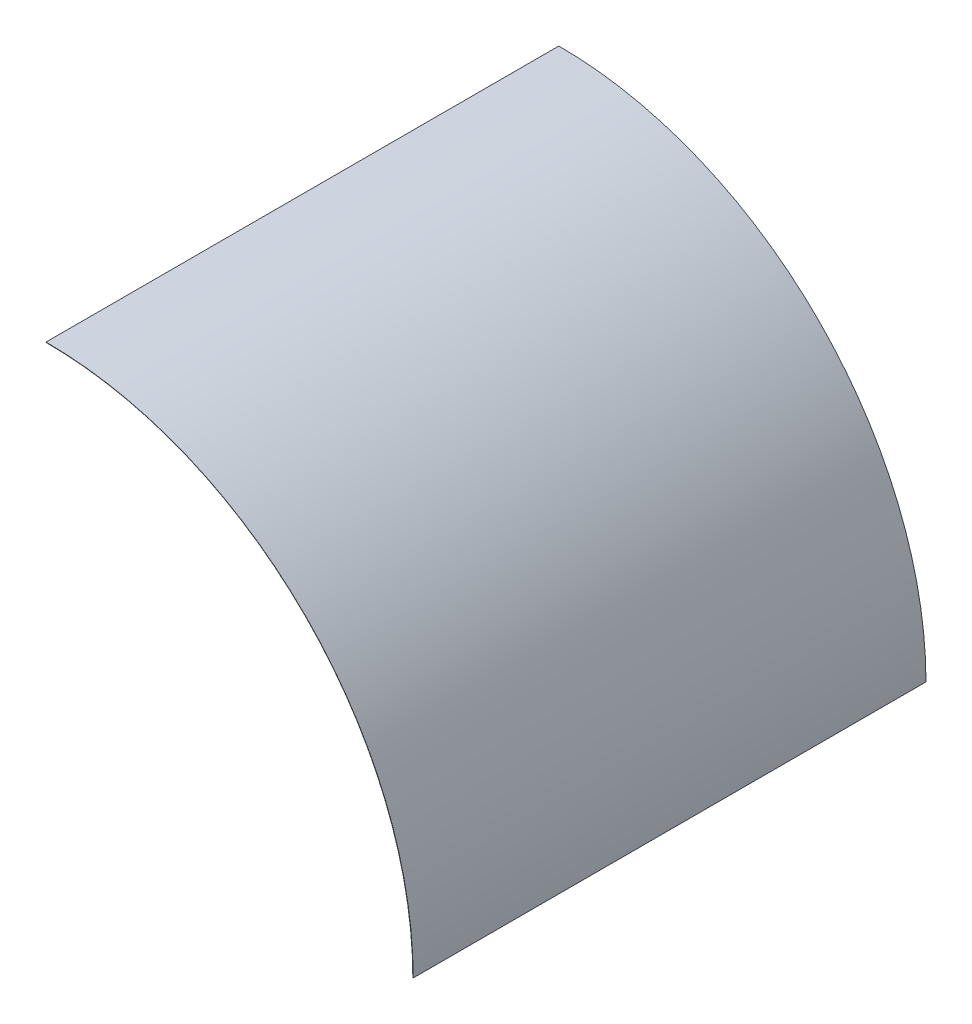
ISO-10303-21;
HEADER;
FILE_DESCRIPTION(('STEP AP214'),'2;1');
FILE_NAME('part.step','',(''),(''),'','','');
FILE_SCHEMA(('AUTOMOTIVE_DESIGN { 1 0 10303 214 1 1 1 1 }'));
ENDSEC;
DATA;
#1=APPLICATION_CONTEXT('core data for automotive mechanical design processes');
#2=APPLICATION_PROTOCOL_DEFINITION('international standard','automotive_design',2000,#1);
#3=PRODUCT_CONTEXT('',#1,'mechanical');
#4=PRODUCT('Part','Part','',(#3));
#5=PRODUCT_RELATED_PRODUCT_CATEGORY('part','',(#4));
#6=PRODUCT_DEFINITION_FORMATION('','',#4);
#7=PRODUCT_DEFINITION_CONTEXT('part definition',#1,'design');
#8=PRODUCT_DEFINITION('design','',#6,#7);
#9=PRODUCT_DEFINITION_SHAPE('','',#8);
#10=(LENGTH_UNIT() NAMED_UNIT(*) SI_UNIT(.MILLI.,.METRE.));
#11=(NAMED_UNIT(*) PLANE_ANGLE_UNIT() SI_UNIT($,.RADIAN.));
#12=(NAMED_UNIT(*) SI_UNIT($,.STERADIAN.) SOLID_ANGLE_UNIT());
#13=UNCERTAINTY_MEASURE_WITH_UNIT(LENGTH_MEASURE(1.E-05),#10,'distance_accuracy_value','');
#14=(GEOMETRIC_REPRESENTATION_CONTEXT(3) GLOBAL_UNCERTAINTY_ASSIGNED_CONTEXT((#13)) GLOBAL_UNIT_ASSIGNED_CONTEXT((#10,
#11,#12)) REPRESENTATION_CONTEXT('',''));
#15=CARTESIAN_POINT('',(0.,0.,0.));
#16=DIRECTION('',(0.,0.,1.));
#17=DIRECTION('',(1.,0.,0.));
#18=AXIS2_PLACEMENT_3D('',#15,#16,#17);
#19=CARTESIAN_POINT('',(0.,0.,-3000.));
#20=DIRECTION('',(0.,0.,1.));
#21=DIRECTION('',(1.,0.,0.));
#22=AXIS2_PLACEMENT_3D('',#19,#20,#21);
#23=CYLINDRICAL_SURFACE('',#22,2146.);
#24=CARTESIAN_POINT('',(0.,0.,0.));
#25=DIRECTION('',(0.,0.,-1.));
#26=DIRECTION('',(-1.,0.,0.));
#27=AXIS2_PLACEMENT_3D('',#24,#25,#26);
#28=CIRCLE('',#27,2146.);
#29=CARTESIAN_POINT('',(0.,2146.,0.));
#30=VERTEX_POINT('',#29);
#31=CARTESIAN_POINT('',(2146.,0.,0.));
#32=VERTEX_POINT('',#31);
#33=EDGE_CURVE('E109',#30,#32,#28,.T.);
#34=ORIENTED_EDGE('',*,*,#33,.F.);
#35=DIRECTION('',(0.,0.,1.));
#36=VECTOR('',#35,1.);
#37=CARTESIAN_POINT('',(0.,2146.,-3000.));
#38=LINE('',#37,#36);
#39=CARTESIAN_POINT('',(0.,2146.,-3000.));
#40=VERTEX_POINT('',#39);
#41=EDGE_CURVE('E11',#40,#30,#38,.T.);
#42=ORIENTED_EDGE('',*,*,#41,.F.);
#43=CARTESIAN_POINT('',(0.,0.,-3000.));
#44=DIRECTION('',(0.,0.,-1.));
#45=DIRECTION('',(-1.,0.,0.));
#46=AXIS2_PLACEMENT_3D('',#43,#44,#45);
#47=CIRCLE('',#46,2146.);
#48=CARTESIAN_POINT('',(2146.,0.,-3000.));
#49=VERTEX_POINT('',#48);
#50=EDGE_CURVE('E101',#40,#49,#47,.T.);
#51=ORIENTED_EDGE('',*,*,#50,.T.);
#52=DIRECTION('',(0.,0.,1.));
#53=VECTOR('',#52,1.);
#54=CARTESIAN_POINT('',(2146.,0.,-3000.));
#55=LINE('',#54,#53);
#56=EDGE_CURVE('E42',#49,#32,#55,.T.);
#57=ORIENTED_EDGE('',*,*,#56,.T.);
#58=EDGE_LOOP('',(#34,#42,#51,#57));
#59=FACE_BOUND('',#58,.T.);
#60=ADVANCED_FACE('F39',(#59),#23,.F.);
#61=CARTESIAN_POINT('',(0.,2148.,-3000.));
#62=DIRECTION('',(-1.,0.,0.));
#63=DIRECTION('',(0.,0.,1.));
#64=AXIS2_PLACEMENT_3D('',#61,#62,#63);
#65=PLANE('',#64);
#66=DIRECTION('',(0.,-1.,0.));
#67=VECTOR('',#66,1.);
#68=CARTESIAN_POINT('',(0.,2148.,0.));
#69=LINE('',#68,#67);
#70=CARTESIAN_POINT('',(0.,2148.,0.));
#71=VERTEX_POINT('',#70);
#72=EDGE_CURVE('E104',#71,#30,#69,.T.);
#73=ORIENTED_EDGE('',*,*,#72,.F.);
#74=DIRECTION('',(0.,0.,1.));
#75=VECTOR('',#74,1.);
#76=CARTESIAN_POINT('',(0.,2148.,-3000.));
#77=LINE('',#76,#75);
#78=CARTESIAN_POINT('',(0.,2148.,-3000.));
#79=VERTEX_POINT('',#78);
#80=EDGE_CURVE('E49',#79,#71,#77,.T.);
#81=ORIENTED_EDGE('',*,*,#80,.F.);
#82=DIRECTION('',(0.,-1.,0.));
#83=VECTOR('',#82,1.);
#84=CARTESIAN_POINT('',(0.,2148.,-3000.));
#85=LINE('',#84,#83);
#86=EDGE_CURVE('E96',#79,#40,#85,.T.);
#87=ORIENTED_EDGE('',*,*,#86,.T.);
#88=ORIENTED_EDGE('',*,*,#41,.T.);
#89=EDGE_LOOP('',(#73,#81,#87,#88));
#90=FACE_BOUND('',#89,.T.);
#91=ADVANCED_FACE('F125',(#90),#65,.T.);
#92=CARTESIAN_POINT('',(0.,0.,-3000.));
#93=DIRECTION('',(0.,0.,1.));
#94=DIRECTION('',(1.,0.,0.));
#95=AXIS2_PLACEMENT_3D('',#92,#93,#94);
#96=CYLINDRICAL_SURFACE('',#95,2148.);
#97=CARTESIAN_POINT('',(0.,0.,0.));
#98=DIRECTION('',(0.,0.,1.));
#99=DIRECTION('',(-1.,0.,0.));
#100=AXIS2_PLACEMENT_3D('',#97,#98,#99);
#101=CIRCLE('',#100,2148.);
#102=CARTESIAN_POINT('',(2148.,2.63054132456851E-13,0.));
#103=VERTEX_POINT('',#102);
#104=EDGE_CURVE('E90',#103,#71,#101,.T.);
#105=ORIENTED_EDGE('',*,*,#104,.F.);
#106=DIRECTION('',(0.,0.,1.));
#107=VECTOR('',#106,1.);
#108=CARTESIAN_POINT('',(2148.,2.63054132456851E-13,-3000.));
#109=LINE('',#108,#107);
#110=CARTESIAN_POINT('',(2148.,2.63054132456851E-13,-3000.));
#111=VERTEX_POINT('',#110);
#112=EDGE_CURVE('E85',#111,#103,#109,.T.);
#113=ORIENTED_EDGE('',*,*,#112,.F.);
#114=CARTESIAN_POINT('',(0.,0.,-3000.));
#115=DIRECTION('',(0.,0.,1.));
#116=DIRECTION('',(-1.,0.,0.));
#117=AXIS2_PLACEMENT_3D('',#114,#115,#116);
#118=CIRCLE('',#117,2148.);
#119=EDGE_CURVE('E88',#111,#79,#118,.T.);
#120=ORIENTED_EDGE('',*,*,#119,.T.);
#121=ORIENTED_EDGE('',*,*,#80,.T.);
#122=EDGE_LOOP('',(#105,#113,#120,#121));
#123=FACE_BOUND('',#122,.T.);
#124=ADVANCED_FACE('F87',(#123),#96,.T.);
#125=CARTESIAN_POINT('',(2148.,0.,-3000.));
#126=DIRECTION('',(0.,-1.,0.));
#127=DIRECTION('',(0.,0.,-1.));
#128=AXIS2_PLACEMENT_3D('',#125,#126,#127);
#129=PLANE('',#128);
#130=DIRECTION('',(1.,0.,0.));
#131=VECTOR('',#130,1.);
#132=CARTESIAN_POINT('',(2148.,0.,0.));
#133=LINE('',#132,#131);
#134=EDGE_CURVE('E113',#32,#103,#133,.T.);
#135=ORIENTED_EDGE('',*,*,#134,.F.);
#136=ORIENTED_EDGE('',*,*,#56,.F.);
#137=DIRECTION('',(1.,0.,0.));
#138=VECTOR('',#137,1.);
#139=CARTESIAN_POINT('',(2148.,0.,-3000.));
#140=LINE('',#139,#138);
#141=EDGE_CURVE('E95',#49,#111,#140,.T.);
#142=ORIENTED_EDGE('',*,*,#141,.T.);
#143=ORIENTED_EDGE('',*,*,#112,.T.);
#144=EDGE_LOOP('',(#135,#136,#142,#143));
#145=FACE_BOUND('',#144,.T.);
#146=ADVANCED_FACE('F99',(#145),#129,.T.);
#147=CARTESIAN_POINT('',(0.,0.,-3000.));
#148=DIRECTION('',(0.,0.,-1.));
#149=DIRECTION('',(-1.,0.,0.));
#150=AXIS2_PLACEMENT_3D('',#147,#148,#149);
#151=PLANE('',#150);
#152=ORIENTED_EDGE('',*,*,#50,.F.);
#153=ORIENTED_EDGE('',*,*,#86,.F.);
#154=ORIENTED_EDGE('',*,*,#119,.F.);
#155=ORIENTED_EDGE('',*,*,#141,.F.);
#156=EDGE_LOOP('',(#152,#153,#154,#155));
#157=FACE_BOUND('',#156,.T.);
#158=ADVANCED_FACE('F94',(#157),#151,.T.);
#159=CARTESIAN_POINT('',(0.,0.,0.));
#160=DIRECTION('',(0.,0.,-1.));
#161=DIRECTION('',(-1.,0.,0.));
#162=AXIS2_PLACEMENT_3D('',#159,#160,#161);
#163=PLANE('',#162);
#164=ORIENTED_EDGE('',*,*,#33,.T.);
#165=ORIENTED_EDGE('',*,*,#134,.T.);
#166=ORIENTED_EDGE('',*,*,#104,.T.);
#167=ORIENTED_EDGE('',*,*,#72,.T.);
#168=EDGE_LOOP('',(#164,#165,#166,#167));
#169=FACE_BOUND('',#168,.T.);
#170=ADVANCED_FACE('F124',(#169),#163,.F.);
#171=CLOSED_SHELL('',(#60,#91,#124,#146,#158,#170));
#172=MANIFOLD_SOLID_BREP('B2',#171);
#173=ADVANCED_BREP_SHAPE_REPRESENTATION('',(#18,#172),#14);
#174=SHAPE_DEFINITION_REPRESENTATION(#9,#173);
ENDSEC;
END-ISO-10303-21;
